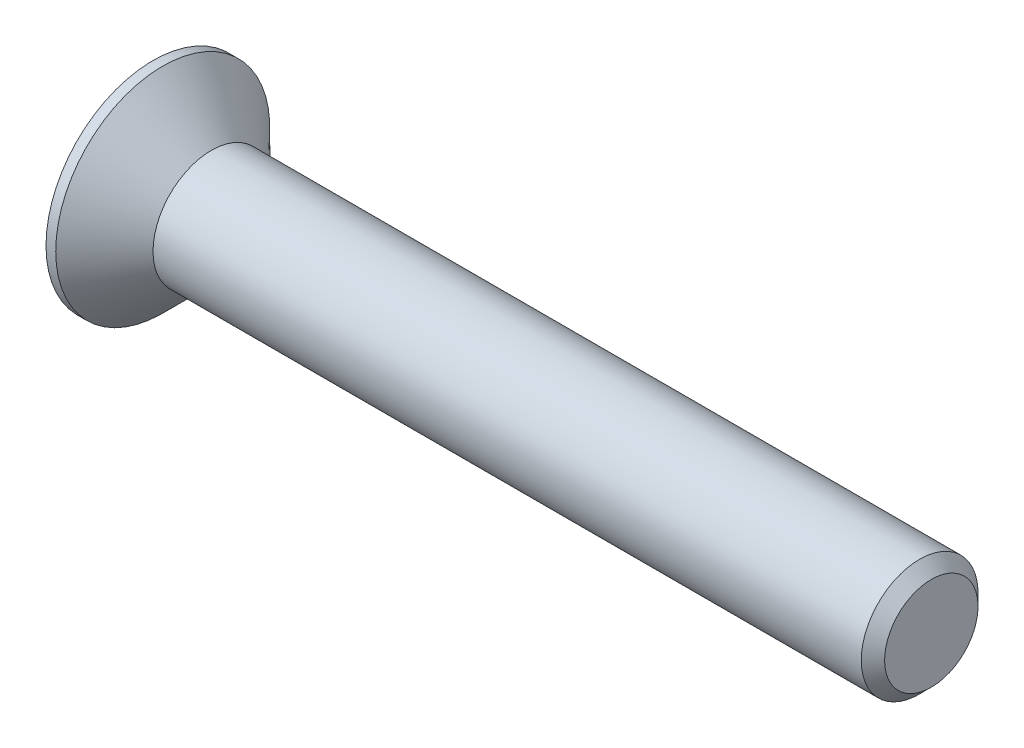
from build123d import *

# Parameters (mm, degrees)
CHAMFER1_SIZE      = 0.6
CUT_EXTRUDE1_DEPTH = 2.5


with BuildPart() as part:
    # Sketch1 → Revolve1 (revolve)
    with BuildSketch(Plane.XY, mode=Mode.PRIVATE) as revolve1_sk:
        Polygon((-3, 5.5), (-3, 0), (37, 0), (37, 3), (0, 3), (-2.5, 5.5), align=None)
    revolve(revolve1_sk.sketch.rotate(Axis((-3, 0, 0), (1, 0, 0)), 90), axis=Axis((-3, 0, 0), (1, 0, 0)))

    # Chamfer1
    chamfer1_edges = [part.edges().sort_by_distance(p)[0] for p in [
        (37, 0, -3),
    ]]
    chamfer(chamfer1_edges, length=CHAMFER1_SIZE)

    # Sketch2 → Cut-Extrude1 (cut)
    with BuildSketch(Plane.ZY.offset(3)):
        Polygon((-0.825, 3.3), (0.825, 3.3), (0.825, 0.825), (3.3, 0.825), (3.3, -0.825), (0.825, -0.825), (0.825, -3.3), (-0.825, -3.3), (-0.825, -0.825), (-3.3, -0.825), (-3.3, 0.825), (-0.825, 0.825), align=None)
    extrude(amount=-CUT_EXTRUDE1_DEPTH, mode=Mode.SUBTRACT)


solid = part.part
